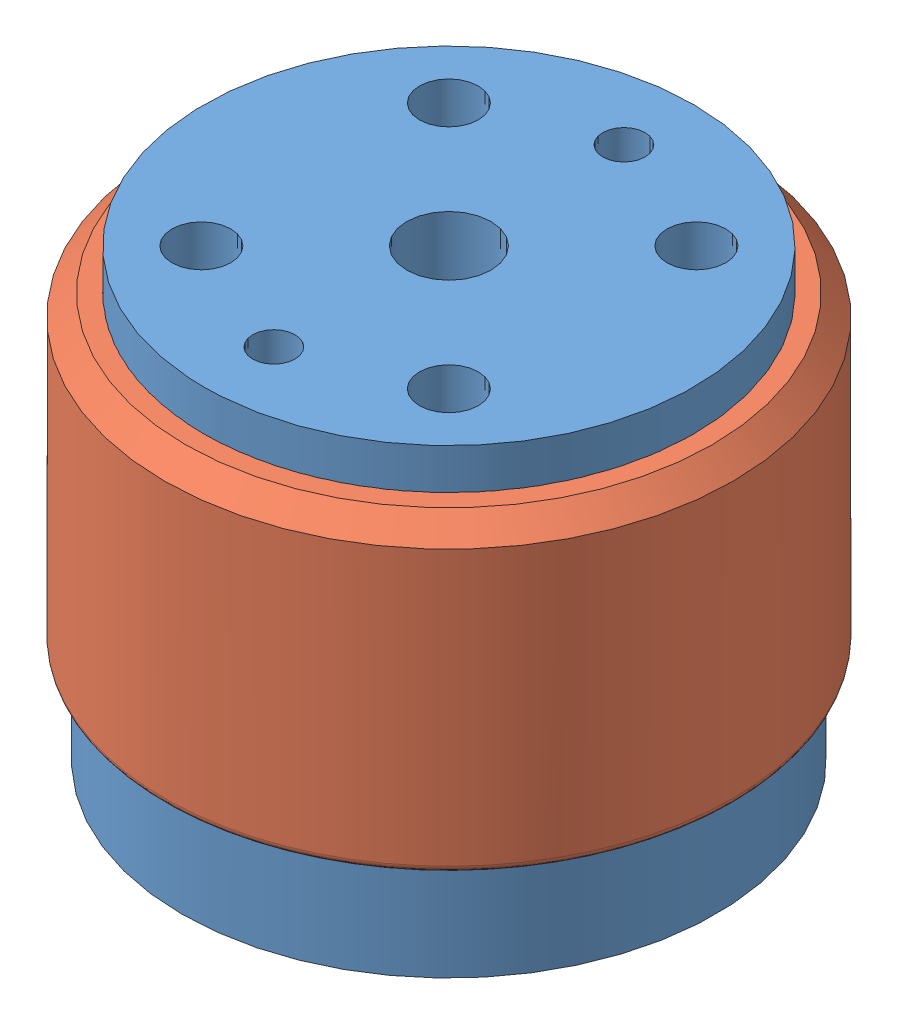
SolidWorks assembly Interface Torque Sensor_CCW.SLDASM, configuration Default (file format 6000). Lengths in mm.
Overall size (40.6 31.8 40.6).
2 component instances, 2 part files, 2 mates.
Components (placement in the parent):
- Interface Torque Transducer Body_CCW-1: Interface Torque Transducer Body_CCW.SLDPRT [Default] at (0.4284 -20.9272 3.1894) size (38.1 31.8 38.1)
- Interface Torque Transducer Shell_CCW-1: Interface Torque Transducer Shell_CCW.SLDPRT [Default] at (0.4284 -13.6272 3.1894) size (40.6 21.63 40.6)
Mates (geometry in assembly coordinates):
- Coincident1: coincident: plane of Interface Torque Transducer Body_CCW-1 through (0.4284 -11.1272 3.1894) normal (0 1 0); plane of Interface Torque Transducer Shell_CCW-1 through (0.4284 -11.1272 3.1894) normal (0 -1 0)
- Concentric1: concentric aligned: cylinder of Interface Torque Transducer Body_CCW-1 through (0.4284 10.8728 3.1894) axis (0 -1 0) radius 17.475; cylinder of Interface Torque Transducer Shell_CCW-1 through (0.4284 7.9728 3.1894) axis (0 -1 0) radius 17.475
